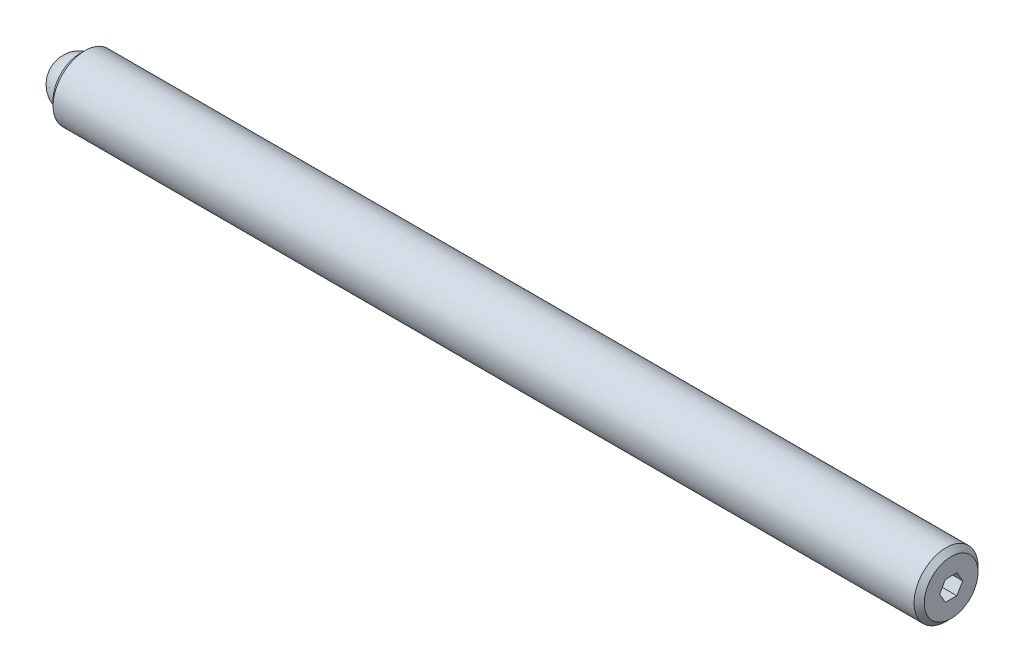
from build123d import *

# Parameters (mm, degrees)
SKETCH2_R           = 3.175
BOSS_EXTRUDE1_DEPTH = 86.51875
CHAMFER1_SIZE       = 0.508
CHAMFER2_SIZE       = 0.508
CUT_EXTRUDE2_DEPTH  = 2.286
SKETCH3_R           = 2.38125
CUT_EXTRUDE3_DEPTH  = 1.984375


with BuildPart() as part:
    # Sketch2 → Boss-Extrude1 (new body)
    with BuildSketch(Plane(origin=(0, 0, 0), x_dir=(0, 0, -1), z_dir=(1, 0, 0))):
        Circle(SKETCH2_R)
    extrude(amount=BOSS_EXTRUDE1_DEPTH)

    # Chamfer1
    chamfer1_edges = [part.edges().sort_by_distance(p)[0] for p in [
        (0, 0, 3.175),
    ]]
    chamfer(chamfer1_edges, length=CHAMFER1_SIZE)

    # Chamfer2
    chamfer2_edges = [part.edges().sort_by_distance(p)[0] for p in [
        (86.51875, 0, 3.175),
    ]]
    chamfer(chamfer2_edges, length=CHAMFER2_SIZE)

    # Sketch4 → Cut-Extrude2 (cut)
    with BuildSketch(Plane(origin=(86.51875, 0, 0), x_dir=(0, 0, -1), z_dir=(1, 0, 0))):
        Polygon((1.14567944, 0), (0.57283972, 0.9921875), (-0.57283972, 0.9921875), (-1.14567944, 0), (-0.57283972, -0.9921875), (0.57283972, -0.9921875), align=None)
    extrude(amount=-CUT_EXTRUDE2_DEPTH, mode=Mode.SUBTRACT)

    # Sketch3 → Cut-Extrude3 (cut)
    with BuildSketch(Plane.ZY):
        Circle(SKETCH3_R)
    extrude(amount=-CUT_EXTRUDE3_DEPTH, mode=Mode.SUBTRACT)


with BuildPart() as body_2:
    # Sketch5 → Revolve1 (revolve)
    with BuildSketch(Plane.ZY):
        with BuildLine():
            Line((0, 0), (0, -2.38125))
            ThreePointArc((0, -2.38125), (-2.38125, 0), (0, 2.38125))
            Line((0, 2.38125), (0, 0))
        make_face()
    revolve(axis=Axis((0, 0, 0), (0, 1, 0)))


solid = Compound([part.part, body_2.part])
